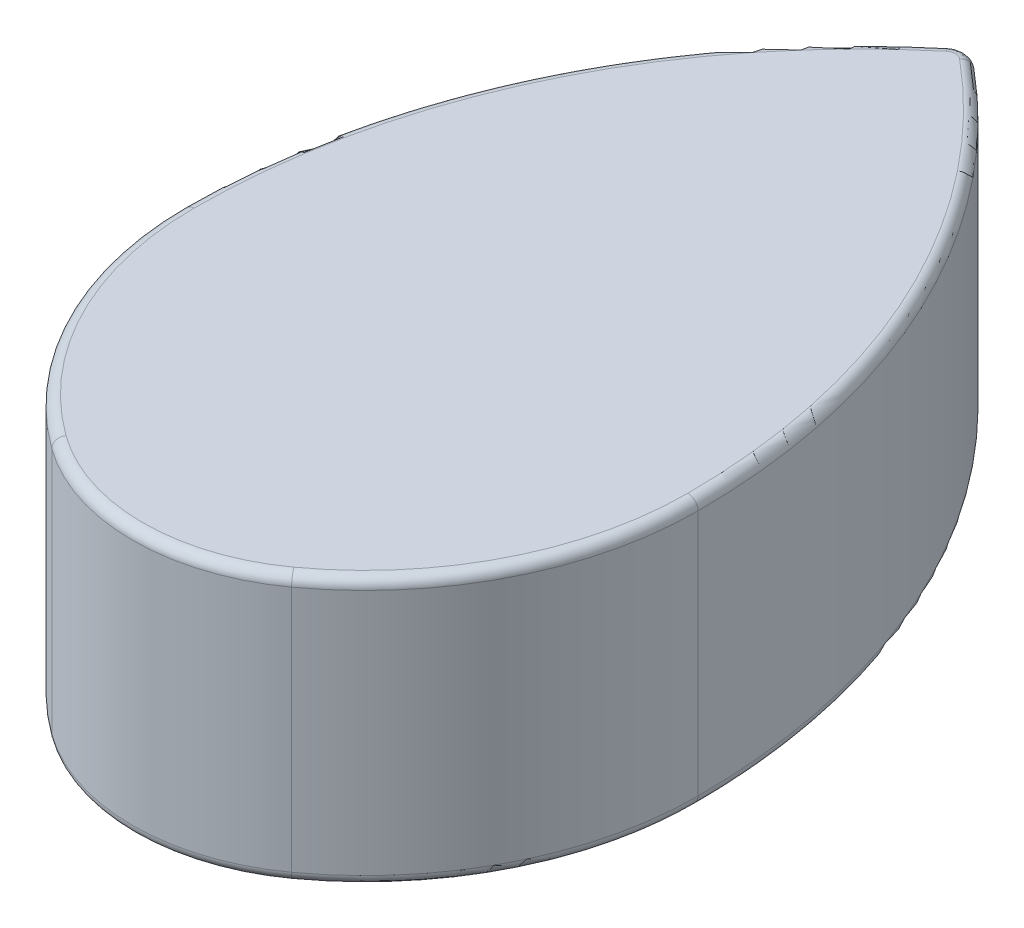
ISO-10303-21;
HEADER;
FILE_DESCRIPTION(('STEP AP214'),'2;1');
FILE_NAME('part.step','',(''),(''),'','','');
FILE_SCHEMA(('AUTOMOTIVE_DESIGN { 1 0 10303 214 1 1 1 1 }'));
ENDSEC;
DATA;
#1=APPLICATION_CONTEXT('core data for automotive mechanical design processes');
#2=APPLICATION_PROTOCOL_DEFINITION('international standard','automotive_design',2000,#1);
#3=PRODUCT_CONTEXT('',#1,'mechanical');
#4=PRODUCT('Part','Part','',(#3));
#5=PRODUCT_RELATED_PRODUCT_CATEGORY('part','',(#4));
#6=PRODUCT_DEFINITION_FORMATION('','',#4);
#7=PRODUCT_DEFINITION_CONTEXT('part definition',#1,'design');
#8=PRODUCT_DEFINITION('design','',#6,#7);
#9=PRODUCT_DEFINITION_SHAPE('','',#8);
#10=(LENGTH_UNIT() NAMED_UNIT(*) SI_UNIT(.MILLI.,.METRE.));
#11=(NAMED_UNIT(*) PLANE_ANGLE_UNIT() SI_UNIT($,.RADIAN.));
#12=(NAMED_UNIT(*) SI_UNIT($,.STERADIAN.) SOLID_ANGLE_UNIT());
#13=UNCERTAINTY_MEASURE_WITH_UNIT(LENGTH_MEASURE(1.E-05),#10,'distance_accuracy_value','');
#14=(GEOMETRIC_REPRESENTATION_CONTEXT(3) GLOBAL_UNCERTAINTY_ASSIGNED_CONTEXT((#13)) GLOBAL_UNIT_ASSIGNED_CONTEXT((#10,
#11,#12)) REPRESENTATION_CONTEXT('',''));
#15=CARTESIAN_POINT('',(0.,0.,0.));
#16=DIRECTION('',(0.,0.,1.));
#17=DIRECTION('',(1.,0.,0.));
#18=AXIS2_PLACEMENT_3D('',#15,#16,#17);
#19=CARTESIAN_POINT('',(7.41103409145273,0.,0.));
#20=DIRECTION('',(0.,1.,0.));
#21=DIRECTION('',(-1.,0.,0.));
#22=AXIS2_PLACEMENT_3D('',#19,#20,#21);
#23=CYLINDRICAL_SURFACE('',#22,32.6110340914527);
#24=CARTESIAN_POINT('',(7.41103409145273,1.,0.));
#25=DIRECTION('',(0.,-1.,0.));
#26=DIRECTION('',(-0.890972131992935,0.,0.454057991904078));
#27=AXIS2_PLACEMENT_3D('',#24,#25,#26);
#28=CIRCLE('',#27,32.6110340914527);
#29=CARTESIAN_POINT('',(-11.7532535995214,1.,26.3857844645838));
#30=VERTEX_POINT('',#29);
#31=CARTESIAN_POINT('',(-25.2,1.,0.));
#32=VERTEX_POINT('',#31);
#33=EDGE_CURVE('E417',#30,#32,#28,.T.);
#34=ORIENTED_EDGE('',*,*,#33,.F.);
#35=DIRECTION('',(0.,-1.,0.));
#36=VECTOR('',#35,1.);
#37=CARTESIAN_POINT('',(-11.7532535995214,0.,26.3857844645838));
#38=LINE('',#37,#36);
#39=CARTESIAN_POINT('',(-11.7532535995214,25.2,26.3857844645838));
#40=VERTEX_POINT('',#39);
#41=EDGE_CURVE('E528',#40,#30,#38,.T.);
#42=ORIENTED_EDGE('',*,*,#41,.F.);
#43=CARTESIAN_POINT('',(7.41103409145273,25.2,0.));
#44=DIRECTION('',(0.,1.,0.));
#45=DIRECTION('',(-0.890972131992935,0.,0.454057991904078));
#46=AXIS2_PLACEMENT_3D('',#43,#44,#45);
#47=CIRCLE('',#46,32.6110340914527);
#48=CARTESIAN_POINT('',(-25.2,25.2,0.));
#49=VERTEX_POINT('',#48);
#50=EDGE_CURVE('E401',#49,#40,#47,.T.);
#51=ORIENTED_EDGE('',*,*,#50,.F.);
#52=DIRECTION('',(0.,1.,0.));
#53=VECTOR('',#52,1.);
#54=CARTESIAN_POINT('',(-25.2,0.,0.));
#55=LINE('',#54,#53);
#56=EDGE_CURVE('E26',#32,#49,#55,.T.);
#57=ORIENTED_EDGE('',*,*,#56,.F.);
#58=EDGE_LOOP('',(#34,#42,#51,#57));
#59=FACE_BOUND('',#58,.T.);
#60=ADVANCED_FACE('F15',(#59),#23,.T.);
#61=CARTESIAN_POINT('',(0.,26.2,-13.3986959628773));
#62=DIRECTION('',(0.,1.,0.));
#63=DIRECTION('',(1.,0.,0.));
#64=AXIS2_PLACEMENT_3D('',#61,#62,#63);
#65=PLANE('',#64);
#66=CARTESIAN_POINT('',(-41.0454120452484,26.2,0.));
#67=DIRECTION('',(0.,-1.,0.));
#68=DIRECTION('',(0.905230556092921,0.,-0.424920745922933));
#69=AXIS2_PLACEMENT_3D('',#66,#67,#68);
#70=CIRCLE('',#69,65.2454120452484);
#71=CARTESIAN_POINT('',(0.638884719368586,26.2,-50.193457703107));
#72=VERTEX_POINT('',#71);
#73=CARTESIAN_POINT('',(24.2,26.2,0.));
#74=VERTEX_POINT('',#73);
#75=EDGE_CURVE('E421',#72,#74,#70,.T.);
#76=ORIENTED_EDGE('',*,*,#75,.F.);
#77=CARTESIAN_POINT('',(0.,26.2,-49.4241552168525));
#78=DIRECTION('',(0.,-1.,0.));
#79=DIRECTION('',(0.,0.,-1.));
#80=AXIS2_PLACEMENT_3D('',#77,#78,#79);
#81=CIRCLE('',#80,1.);
#82=CARTESIAN_POINT('',(-0.638884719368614,26.2,-50.193457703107));
#83=VERTEX_POINT('',#82);
#84=EDGE_CURVE('E388',#83,#72,#81,.T.);
#85=ORIENTED_EDGE('',*,*,#84,.F.);
#86=CARTESIAN_POINT('',(41.0454120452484,26.2,0.));
#87=DIRECTION('',(0.,-1.,0.));
#88=DIRECTION('',(-0.905230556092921,0.,-0.424920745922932));
#89=AXIS2_PLACEMENT_3D('',#86,#87,#88);
#90=CIRCLE('',#89,65.2454120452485);
#91=CARTESIAN_POINT('',(-24.2,26.2,0.));
#92=VERTEX_POINT('',#91);
#93=EDGE_CURVE('E435',#92,#83,#90,.T.);
#94=ORIENTED_EDGE('',*,*,#93,.F.);
#95=CARTESIAN_POINT('',(7.41103409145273,26.2,0.));
#96=DIRECTION('',(0.,-1.,0.));
#97=DIRECTION('',(-0.890972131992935,0.,0.454057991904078));
#98=AXIS2_PLACEMENT_3D('',#95,#96,#97);
#99=CIRCLE('',#98,31.6110340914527);
#100=CARTESIAN_POINT('',(-11.1655909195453,26.2,25.5766784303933));
#101=VERTEX_POINT('',#100);
#102=EDGE_CURVE('E408',#101,#92,#99,.T.);
#103=ORIENTED_EDGE('',*,*,#102,.F.);
#104=CARTESIAN_POINT('',(0.,26.2,10.2036637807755));
#105=DIRECTION('',(0.,-1.,0.));
#106=DIRECTION('',(0.,0.,1.));
#107=AXIS2_PLACEMENT_3D('',#104,#105,#106);
#108=CIRCLE('',#107,19.);
#109=CARTESIAN_POINT('',(11.1655909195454,26.2,25.5766784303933));
#110=VERTEX_POINT('',#109);
#111=EDGE_CURVE('E400',#110,#101,#108,.T.);
#112=ORIENTED_EDGE('',*,*,#111,.F.);
#113=CARTESIAN_POINT('',(-7.41103409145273,26.2,0.));
#114=DIRECTION('',(0.,-1.,0.));
#115=DIRECTION('',(0.890972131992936,0.,0.454057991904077));
#116=AXIS2_PLACEMENT_3D('',#113,#114,#115);
#117=CIRCLE('',#116,31.6110340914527);
#118=EDGE_CURVE('E40',#74,#110,#117,.T.);
#119=ORIENTED_EDGE('',*,*,#118,.F.);
#120=EDGE_LOOP('',(#76,#85,#94,#103,#112,#119));
#121=FACE_BOUND('',#120,.T.);
#122=ADVANCED_FACE('F508',(#121),#65,.T.);
#123=CARTESIAN_POINT('',(0.,0.,-49.4241552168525));
#124=DIRECTION('',(0.,1.,0.));
#125=DIRECTION('',(0.,0.,-1.));
#126=AXIS2_PLACEMENT_3D('',#123,#124,#125);
#127=CYLINDRICAL_SURFACE('',#126,2.);
#128=CARTESIAN_POINT('',(0.,1.,-49.4241552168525));
#129=DIRECTION('',(0.,-1.,0.));
#130=DIRECTION('',(0.,0.,-1.));
#131=AXIS2_PLACEMENT_3D('',#128,#129,#130);
#132=CIRCLE('',#131,2.);
#133=CARTESIAN_POINT('',(-1.27776943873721,1.,-50.9627601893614));
#134=VERTEX_POINT('',#133);
#135=CARTESIAN_POINT('',(1.27776943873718,1.,-50.9627601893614));
#136=VERTEX_POINT('',#135);
#137=EDGE_CURVE('E452',#134,#136,#132,.T.);
#138=ORIENTED_EDGE('',*,*,#137,.F.);
#139=DIRECTION('',(0.,1.,0.));
#140=VECTOR('',#139,1.);
#141=CARTESIAN_POINT('',(-1.27776943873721,0.,-50.9627601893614));
#142=LINE('',#141,#140);
#143=CARTESIAN_POINT('',(-1.27776943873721,25.2,-50.9627601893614));
#144=VERTEX_POINT('',#143);
#145=EDGE_CURVE('E10',#134,#144,#142,.T.);
#146=ORIENTED_EDGE('',*,*,#145,.T.);
#147=CARTESIAN_POINT('',(0.,25.2,-49.4241552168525));
#148=DIRECTION('',(0.,1.,0.));
#149=DIRECTION('',(0.,0.,-1.));
#150=AXIS2_PLACEMENT_3D('',#147,#148,#149);
#151=CIRCLE('',#150,2.);
#152=CARTESIAN_POINT('',(1.27776943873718,25.2,-50.9627601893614));
#153=VERTEX_POINT('',#152);
#154=EDGE_CURVE('E392',#153,#144,#151,.T.);
#155=ORIENTED_EDGE('',*,*,#154,.F.);
#156=DIRECTION('',(0.,-1.,0.));
#157=VECTOR('',#156,1.);
#158=CARTESIAN_POINT('',(1.27776943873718,0.,-50.9627601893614));
#159=LINE('',#158,#157);
#160=EDGE_CURVE('E447',#153,#136,#159,.T.);
#161=ORIENTED_EDGE('',*,*,#160,.T.);
#162=EDGE_LOOP('',(#138,#146,#155,#161));
#163=FACE_BOUND('',#162,.T.);
#164=ADVANCED_FACE('F485',(#163),#127,.T.);
#165=CARTESIAN_POINT('',(41.0454120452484,0.,0.));
#166=DIRECTION('',(0.,1.,0.));
#167=DIRECTION('',(-0.619596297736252,0.,-0.784920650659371));
#168=AXIS2_PLACEMENT_3D('',#165,#166,#167);
#169=CYLINDRICAL_SURFACE('',#168,66.2454120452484);
#170=CARTESIAN_POINT('',(41.0454120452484,1.,0.));
#171=DIRECTION('',(0.,-1.,0.));
#172=DIRECTION('',(-0.905230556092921,0.,-0.424920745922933));
#173=AXIS2_PLACEMENT_3D('',#170,#171,#172);
#174=CIRCLE('',#173,66.2454120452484);
#175=EDGE_CURVE('E541',#32,#134,#174,.T.);
#176=ORIENTED_EDGE('',*,*,#175,.F.);
#177=ORIENTED_EDGE('',*,*,#56,.T.);
#178=CARTESIAN_POINT('',(41.0454120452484,25.2,0.));
#179=DIRECTION('',(0.,1.,0.));
#180=DIRECTION('',(-0.905230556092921,0.,-0.424920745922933));
#181=AXIS2_PLACEMENT_3D('',#178,#179,#180);
#182=CIRCLE('',#181,66.2454120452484);
#183=EDGE_CURVE('E454',#144,#49,#182,.T.);
#184=ORIENTED_EDGE('',*,*,#183,.F.);
#185=ORIENTED_EDGE('',*,*,#145,.F.);
#186=EDGE_LOOP('',(#176,#177,#184,#185));
#187=FACE_BOUND('',#186,.T.);
#188=ADVANCED_FACE('F478',(#187),#169,.T.);
#189=CARTESIAN_POINT('',(-7.41103409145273,25.2,0.));
#190=DIRECTION('',(0.,1.,0.));
#191=DIRECTION('',(0.,0.,1.));
#192=AXIS2_PLACEMENT_3D('',#189,#190,#191);
#193=TOROIDAL_SURFACE('',#192,31.6110340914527,1.);
#194=CARTESIAN_POINT('',(24.2,25.2,0.));
#195=DIRECTION('',(0.,0.,-1.));
#196=DIRECTION('',(0.,1.,0.));
#197=AXIS2_PLACEMENT_3D('',#194,#195,#196);
#198=CIRCLE('',#197,1.);
#199=CARTESIAN_POINT('',(25.2,25.2,0.));
#200=VERTEX_POINT('',#199);
#201=EDGE_CURVE('E440',#74,#200,#198,.T.);
#202=ORIENTED_EDGE('',*,*,#201,.F.);
#203=ORIENTED_EDGE('',*,*,#118,.T.);
#204=CARTESIAN_POINT('',(11.1655909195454,25.2,25.5766784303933));
#205=DIRECTION('',(-0.809106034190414,0.,0.587662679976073));
#206=DIRECTION('',(0.587662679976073,0.,0.809106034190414));
#207=AXIS2_PLACEMENT_3D('',#204,#205,#206);
#208=CIRCLE('',#207,1.);
#209=CARTESIAN_POINT('',(11.7532535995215,25.2,26.3857844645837));
#210=VERTEX_POINT('',#209);
#211=EDGE_CURVE('E396',#210,#110,#208,.T.);
#212=ORIENTED_EDGE('',*,*,#211,.F.);
#213=CARTESIAN_POINT('',(-7.41103409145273,25.2,0.));
#214=DIRECTION('',(0.,1.,0.));
#215=DIRECTION('',(0.890972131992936,0.,0.454057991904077));
#216=AXIS2_PLACEMENT_3D('',#213,#214,#215);
#217=CIRCLE('',#216,32.6110340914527);
#218=EDGE_CURVE('E443',#210,#200,#217,.T.);
#219=ORIENTED_EDGE('',*,*,#218,.T.);
#220=EDGE_LOOP('',(#202,#203,#212,#219));
#221=FACE_BOUND('',#220,.T.);
#222=ADVANCED_FACE('F475',(#221),#193,.T.);
#223=CARTESIAN_POINT('',(0.,25.2,10.2036637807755));
#224=DIRECTION('',(0.,-1.,0.));
#225=DIRECTION('',(0.,0.,1.));
#226=AXIS2_PLACEMENT_3D('',#223,#224,#225);
#227=TOROIDAL_SURFACE('',#226,19.,1.);
#228=ORIENTED_EDGE('',*,*,#211,.T.);
#229=ORIENTED_EDGE('',*,*,#111,.T.);
#230=CARTESIAN_POINT('',(-11.1655909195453,25.2,25.5766784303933));
#231=DIRECTION('',(-0.809106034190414,0.,-0.587662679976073));
#232=DIRECTION('',(-0.587662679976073,0.,0.809106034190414));
#233=AXIS2_PLACEMENT_3D('',#230,#231,#232);
#234=CIRCLE('',#233,1.);
#235=EDGE_CURVE('E412',#40,#101,#234,.T.);
#236=ORIENTED_EDGE('',*,*,#235,.F.);
#237=CARTESIAN_POINT('',(0.,25.2,10.2036637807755));
#238=DIRECTION('',(0.,1.,0.));
#239=DIRECTION('',(0.,0.,1.));
#240=AXIS2_PLACEMENT_3D('',#237,#238,#239);
#241=CIRCLE('',#240,20.);
#242=EDGE_CURVE('E406',#40,#210,#241,.T.);
#243=ORIENTED_EDGE('',*,*,#242,.T.);
#244=EDGE_LOOP('',(#228,#229,#236,#243));
#245=FACE_BOUND('',#244,.T.);
#246=ADVANCED_FACE('F273',(#245),#227,.T.);
#247=CARTESIAN_POINT('',(7.41103409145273,25.2,0.));
#248=DIRECTION('',(0.,1.,0.));
#249=DIRECTION('',(0.,0.,1.));
#250=AXIS2_PLACEMENT_3D('',#247,#248,#249);
#251=TOROIDAL_SURFACE('',#250,31.6110340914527,1.);
#252=ORIENTED_EDGE('',*,*,#235,.T.);
#253=ORIENTED_EDGE('',*,*,#102,.T.);
#254=CARTESIAN_POINT('',(-24.2,25.2,0.));
#255=DIRECTION('',(0.,0.,-1.));
#256=DIRECTION('',(-1.,0.,0.));
#257=AXIS2_PLACEMENT_3D('',#254,#255,#256);
#258=CIRCLE('',#257,0.999999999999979);
#259=EDGE_CURVE('E431',#49,#92,#258,.T.);
#260=ORIENTED_EDGE('',*,*,#259,.F.);
#261=ORIENTED_EDGE('',*,*,#50,.T.);
#262=EDGE_LOOP('',(#252,#253,#260,#261));
#263=FACE_BOUND('',#262,.T.);
#264=ADVANCED_FACE('F501',(#263),#251,.T.);
#265=CARTESIAN_POINT('',(41.0454120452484,25.2,0.));
#266=DIRECTION('',(0.,1.,0.));
#267=DIRECTION('',(0.,0.,1.));
#268=AXIS2_PLACEMENT_3D('',#265,#266,#267);
#269=TOROIDAL_SURFACE('',#268,65.2454120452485,1.);
#270=ORIENTED_EDGE('',*,*,#259,.T.);
#271=ORIENTED_EDGE('',*,*,#93,.T.);
#272=CARTESIAN_POINT('',(-0.638884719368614,25.2,-50.193457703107));
#273=DIRECTION('',(0.76930248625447,0.,-0.638884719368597));
#274=DIRECTION('',(-0.638884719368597,0.,-0.76930248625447));
#275=AXIS2_PLACEMENT_3D('',#272,#273,#274);
#276=CIRCLE('',#275,1.);
#277=EDGE_CURVE('E393',#144,#83,#276,.T.);
#278=ORIENTED_EDGE('',*,*,#277,.F.);
#279=ORIENTED_EDGE('',*,*,#183,.T.);
#280=EDGE_LOOP('',(#270,#271,#278,#279));
#281=FACE_BOUND('',#280,.T.);
#282=ADVANCED_FACE('F498',(#281),#269,.T.);
#283=CARTESIAN_POINT('',(-0.638884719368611,26.2,-50.193457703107));
#284=CARTESIAN_POINT('',(0.,26.2,-50.7240340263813));
#285=CARTESIAN_POINT('',(0.638884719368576,26.2,-50.1934577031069));
#286=CARTESIAN_POINT('',(-1.2777694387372,26.2,-50.9627601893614));
#287=CARTESIAN_POINT('',(0.,26.2,-52.0239128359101));
#288=CARTESIAN_POINT('',(1.27776943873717,26.2,-50.9627601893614));
#289=CARTESIAN_POINT('',(-1.2777694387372,25.2,-50.9627601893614));
#290=CARTESIAN_POINT('',(0.,25.2,-52.0239128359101));
#291=CARTESIAN_POINT('',(1.27776943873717,25.2,-50.9627601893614));
#292=(BOUNDED_SURFACE() B_SPLINE_SURFACE(2,2,((#283,#284,#285),(#286,#287,#288),(#289,#290,
#291)),.UNSPECIFIED.,.F.,.F.,.F.) B_SPLINE_SURFACE_WITH_KNOTS((3,3),(3,3),(-1.5707963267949,0.),
(-0.693047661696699,0.6930476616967),
.UNSPECIFIED.) GEOMETRIC_REPRESENTATION_ITEM() RATIONAL_B_SPLINE_SURFACE(((1.,0.769302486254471,
1.),(0.707106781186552,0.543979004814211,0.707106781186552),(1.,0.769302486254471,1.))) REPRESENTATION_ITEM('') SURFACE());
#293=CARTESIAN_POINT('',(0.638884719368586,25.2,-50.193457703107));
#294=DIRECTION('',(0.769302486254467,0.,0.638884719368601));
#295=DIRECTION('',(0.638884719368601,0.,-0.769302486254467));
#296=AXIS2_PLACEMENT_3D('',#293,#294,#295);
#297=CIRCLE('',#296,0.999999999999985);
#298=EDGE_CURVE('E436',#153,#72,#297,.T.);
#299=ORIENTED_EDGE('',*,*,#277,.T.);
#300=ORIENTED_EDGE('',*,*,#84,.T.);
#301=ORIENTED_EDGE('',*,*,#298,.F.);
#302=ORIENTED_EDGE('',*,*,#154,.T.);
#303=EDGE_LOOP('',(#299,#300,#301,#302));
#304=FACE_BOUND('',#303,.T.);
#305=ADVANCED_FACE('F340',(#304),#292,.F.);
#306=CARTESIAN_POINT('',(-41.0454120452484,25.2,0.));
#307=DIRECTION('',(0.,1.,0.));
#308=DIRECTION('',(0.,0.,1.));
#309=AXIS2_PLACEMENT_3D('',#306,#307,#308);
#310=TOROIDAL_SURFACE('',#309,65.2454120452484,1.);
#311=ORIENTED_EDGE('',*,*,#201,.T.);
#312=CARTESIAN_POINT('',(-41.0454120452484,25.2,0.));
#313=DIRECTION('',(0.,1.,0.));
#314=DIRECTION('',(0.905230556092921,0.,-0.424920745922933));
#315=AXIS2_PLACEMENT_3D('',#312,#313,#314);
#316=CIRCLE('',#315,66.2454120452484);
#317=EDGE_CURVE('E561',#200,#153,#316,.T.);
#318=ORIENTED_EDGE('',*,*,#317,.T.);
#319=ORIENTED_EDGE('',*,*,#298,.T.);
#320=ORIENTED_EDGE('',*,*,#75,.T.);
#321=EDGE_LOOP('',(#311,#318,#319,#320));
#322=FACE_BOUND('',#321,.T.);
#323=ADVANCED_FACE('F496',(#322),#310,.T.);
#324=CARTESIAN_POINT('',(0.,0.,-13.3986959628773));
#325=DIRECTION('',(0.,1.,0.));
#326=DIRECTION('',(1.,0.,0.));
#327=AXIS2_PLACEMENT_3D('',#324,#325,#326);
#328=PLANE('',#327);
#329=CARTESIAN_POINT('',(0.,0.,0.));
#330=DIRECTION('',(0.,1.,0.));
#331=DIRECTION('',(1.,0.,0.));
#332=AXIS2_PLACEMENT_3D('',#329,#330,#331);
#333=CIRCLE('',#332,24.25);
#334=CARTESIAN_POINT('',(-24.0365612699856,0.,3.21033056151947));
#335=VERTEX_POINT('',#334);
#336=CARTESIAN_POINT('',(24.0365612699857,0.,3.2103305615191));
#337=VERTEX_POINT('',#336);
#338=EDGE_CURVE('E200',#335,#337,#333,.T.);
#339=ORIENTED_EDGE('',*,*,#338,.T.);
#340=CARTESIAN_POINT('',(-7.41103409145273,0.,0.));
#341=DIRECTION('',(0.,1.,0.));
#342=DIRECTION('',(0.890972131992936,0.,0.454057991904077));
#343=AXIS2_PLACEMENT_3D('',#340,#341,#342);
#344=CIRCLE('',#343,31.6110340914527);
#345=CARTESIAN_POINT('',(11.1655909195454,0.,25.5766784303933));
#346=VERTEX_POINT('',#345);
#347=EDGE_CURVE('E564',#346,#337,#344,.T.);
#348=ORIENTED_EDGE('',*,*,#347,.F.);
#349=CARTESIAN_POINT('',(0.,0.,10.2036637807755));
#350=DIRECTION('',(0.,1.,0.));
#351=DIRECTION('',(0.,0.,1.));
#352=AXIS2_PLACEMENT_3D('',#349,#350,#351);
#353=CIRCLE('',#352,19.);
#354=CARTESIAN_POINT('',(-11.1655909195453,0.,25.5766784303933));
#355=VERTEX_POINT('',#354);
#356=EDGE_CURVE('E407',#355,#346,#353,.T.);
#357=ORIENTED_EDGE('',*,*,#356,.F.);
#358=CARTESIAN_POINT('',(7.41103409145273,0.,0.));
#359=DIRECTION('',(0.,1.,0.));
#360=DIRECTION('',(-0.890972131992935,0.,0.454057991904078));
#361=AXIS2_PLACEMENT_3D('',#358,#359,#360);
#362=CIRCLE('',#361,31.6110340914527);
#363=EDGE_CURVE('E535',#335,#355,#362,.T.);
#364=ORIENTED_EDGE('',*,*,#363,.F.);
#365=EDGE_LOOP('',(#339,#348,#357,#364));
#366=FACE_BOUND('',#365,.T.);
#367=ADVANCED_FACE('F493',(#366),#328,.F.);
#368=CARTESIAN_POINT('',(-41.0454120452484,0.,0.));
#369=DIRECTION('',(0.,1.,0.));
#370=DIRECTION('',(1.,0.,0.));
#371=AXIS2_PLACEMENT_3D('',#368,#369,#370);
#372=CYLINDRICAL_SURFACE('',#371,66.2454120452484);
#373=CARTESIAN_POINT('',(-41.0454120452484,1.,0.));
#374=DIRECTION('',(0.,-1.,0.));
#375=DIRECTION('',(0.905230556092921,0.,-0.424920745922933));
#376=AXIS2_PLACEMENT_3D('',#373,#374,#375);
#377=CIRCLE('',#376,66.2454120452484);
#378=CARTESIAN_POINT('',(25.2,1.,0.));
#379=VERTEX_POINT('',#378);
#380=EDGE_CURVE('E453',#136,#379,#377,.T.);
#381=ORIENTED_EDGE('',*,*,#380,.F.);
#382=ORIENTED_EDGE('',*,*,#160,.F.);
#383=ORIENTED_EDGE('',*,*,#317,.F.);
#384=DIRECTION('',(0.,1.,0.));
#385=VECTOR('',#384,1.);
#386=CARTESIAN_POINT('',(25.2,0.,0.));
#387=LINE('',#386,#385);
#388=EDGE_CURVE('E448',#379,#200,#387,.T.);
#389=ORIENTED_EDGE('',*,*,#388,.F.);
#390=EDGE_LOOP('',(#381,#382,#383,#389));
#391=FACE_BOUND('',#390,.T.);
#392=ADVANCED_FACE('F226',(#391),#372,.T.);
#393=CARTESIAN_POINT('',(-7.41103409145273,0.,0.));
#394=DIRECTION('',(0.,1.,0.));
#395=DIRECTION('',(0.227255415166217,0.,0.97383518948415));
#396=AXIS2_PLACEMENT_3D('',#393,#394,#395);
#397=CYLINDRICAL_SURFACE('',#396,32.6110340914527);
#398=CARTESIAN_POINT('',(-7.41103409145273,1.,0.));
#399=DIRECTION('',(0.,-1.,0.));
#400=DIRECTION('',(0.890972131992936,0.,0.454057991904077));
#401=AXIS2_PLACEMENT_3D('',#398,#399,#400);
#402=CIRCLE('',#401,32.6110340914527);
#403=CARTESIAN_POINT('',(11.7532535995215,1.,26.3857844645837));
#404=VERTEX_POINT('',#403);
#405=EDGE_CURVE('E545',#379,#404,#402,.T.);
#406=ORIENTED_EDGE('',*,*,#405,.F.);
#407=ORIENTED_EDGE('',*,*,#388,.T.);
#408=ORIENTED_EDGE('',*,*,#218,.F.);
#409=DIRECTION('',(0.,1.,0.));
#410=VECTOR('',#409,1.);
#411=CARTESIAN_POINT('',(11.7532535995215,0.,26.3857844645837));
#412=LINE('',#411,#410);
#413=EDGE_CURVE('E402',#404,#210,#412,.T.);
#414=ORIENTED_EDGE('',*,*,#413,.F.);
#415=EDGE_LOOP('',(#406,#407,#408,#414));
#416=FACE_BOUND('',#415,.T.);
#417=ADVANCED_FACE('F479',(#416),#397,.T.);
#418=CARTESIAN_POINT('',(0.,0.,10.2036637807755));
#419=DIRECTION('',(0.,1.,0.));
#420=DIRECTION('',(0.,0.,1.));
#421=AXIS2_PLACEMENT_3D('',#418,#419,#420);
#422=CYLINDRICAL_SURFACE('',#421,20.);
#423=CARTESIAN_POINT('',(0.,1.,10.2036637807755));
#424=DIRECTION('',(0.,-1.,0.));
#425=DIRECTION('',(0.,0.,1.));
#426=AXIS2_PLACEMENT_3D('',#423,#424,#425);
#427=CIRCLE('',#426,20.);
#428=EDGE_CURVE('E413',#404,#30,#427,.T.);
#429=ORIENTED_EDGE('',*,*,#428,.F.);
#430=ORIENTED_EDGE('',*,*,#413,.T.);
#431=ORIENTED_EDGE('',*,*,#242,.F.);
#432=ORIENTED_EDGE('',*,*,#41,.T.);
#433=EDGE_LOOP('',(#429,#430,#431,#432));
#434=FACE_BOUND('',#433,.T.);
#435=ADVANCED_FACE('F233',(#434),#422,.T.);
#436=CARTESIAN_POINT('',(0.,1.,10.2036637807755));
#437=DIRECTION('',(0.,1.,0.));
#438=DIRECTION('',(0.,0.,1.));
#439=AXIS2_PLACEMENT_3D('',#436,#437,#438);
#440=TOROIDAL_SURFACE('',#439,19.,1.);
#441=CARTESIAN_POINT('',(11.1655909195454,1.,25.5766784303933));
#442=DIRECTION('',(-0.809106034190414,0.,0.587662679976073));
#443=DIRECTION('',(0.,-1.,0.));
#444=AXIS2_PLACEMENT_3D('',#441,#442,#443);
#445=CIRCLE('',#444,1.);
#446=EDGE_CURVE('E549',#346,#404,#445,.T.);
#447=ORIENTED_EDGE('',*,*,#446,.T.);
#448=ORIENTED_EDGE('',*,*,#428,.T.);
#449=CARTESIAN_POINT('',(-11.1655909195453,1.,25.5766784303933));
#450=DIRECTION('',(-0.809106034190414,0.,-0.587662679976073));
#451=DIRECTION('',(0.,-1.,0.));
#452=AXIS2_PLACEMENT_3D('',#449,#450,#451);
#453=CIRCLE('',#452,1.);
#454=EDGE_CURVE('E532',#355,#30,#453,.T.);
#455=ORIENTED_EDGE('',*,*,#454,.F.);
#456=ORIENTED_EDGE('',*,*,#356,.T.);
#457=EDGE_LOOP('',(#447,#448,#455,#456));
#458=FACE_BOUND('',#457,.T.);
#459=ADVANCED_FACE('F225',(#458),#440,.T.);
#460=CARTESIAN_POINT('',(7.41103409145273,1.,0.));
#461=DIRECTION('',(0.,1.,0.));
#462=DIRECTION('',(0.,0.,1.));
#463=AXIS2_PLACEMENT_3D('',#460,#461,#462);
#464=TOROIDAL_SURFACE('',#463,31.6110340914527,1.);
#465=CARTESIAN_POINT('',(-24.25,0.00125078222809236,0.));
#466=CARTESIAN_POINT('',(-24.250000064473,0.00125121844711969,0.133990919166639));
#467=CARTESIAN_POINT('',(-24.2488891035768,0.00123776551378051,0.267981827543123));
#468=CARTESIAN_POINT('',(-24.2444453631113,0.00118624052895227,0.535983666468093));
#469=CARTESIAN_POINT('',(-24.2411116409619,0.00114815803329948,0.669994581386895));
#470=CARTESIAN_POINT('',(-24.2322208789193,0.00105051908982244,0.937994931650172));
#471=CARTESIAN_POINT('',(-24.2266629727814,0.00099095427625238,1.07198433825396));
#472=CARTESIAN_POINT('',(-24.2133231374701,0.000856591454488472,1.33990011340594));
#473=CARTESIAN_POINT('',(-24.2055404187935,0.000781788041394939,1.47382644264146));
#474=CARTESIAN_POINT('',(-24.1877509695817,0.000625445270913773,1.7415744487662));
#475=CARTESIAN_POINT('',(-24.1777435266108,0.000543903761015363,1.87539607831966));
#476=CARTESIAN_POINT('',(-24.1555054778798,0.000385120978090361,2.14289303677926));
#477=CARTESIAN_POINT('',(-24.1432742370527,0.000307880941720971,2.27656831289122));
#478=CARTESIAN_POINT('',(-24.1165902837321,0.000170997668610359,2.54373089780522));
#479=CARTESIAN_POINT('',(-24.1021370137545,0.00011135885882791,2.6772181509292));
#480=CARTESIAN_POINT('',(-24.0710119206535,2.60740297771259E-05,2.94396306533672));
#481=CARTESIAN_POINT('',(-24.0543396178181,4.35373861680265E-07,3.07722067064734));
#482=CARTESIAN_POINT('',(-24.0365612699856,0.,3.21033056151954));
#483=B_SPLINE_CURVE_WITH_KNOTS('',3,(#465,#466,#467,#468,#469,#470,#471,#472,#473,#474,#475,
#476,#477,#478,#479,#480,#481,#482),.UNSPECIFIED.,.F.,.F.,(4,2,2,2,2,2,2,2,4),(0.,
0.401968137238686,0.804106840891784,1.2064023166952,1.60884072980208,2.01140820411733,
2.41409082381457,2.81687463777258,3.21974566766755),.UNSPECIFIED.);
#484=CARTESIAN_POINT('',(-24.25,0.00125078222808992,0.));
#485=VERTEX_POINT('',#484);
#486=EDGE_CURVE('E192',#485,#335,#483,.T.);
#487=ORIENTED_EDGE('',*,*,#486,.T.);
#488=ORIENTED_EDGE('',*,*,#363,.T.);
#489=ORIENTED_EDGE('',*,*,#454,.T.);
#490=ORIENTED_EDGE('',*,*,#33,.T.);
#491=CARTESIAN_POINT('',(-24.2,1.,0.));
#492=DIRECTION('',(0.,0.,-1.));
#493=DIRECTION('',(0.,-1.,0.));
#494=AXIS2_PLACEMENT_3D('',#491,#492,#493);
#495=CIRCLE('',#494,1.);
#496=EDGE_CURVE('E558',#485,#32,#495,.T.);
#497=ORIENTED_EDGE('',*,*,#496,.F.);
#498=EDGE_LOOP('',(#487,#488,#489,#490,#497));
#499=FACE_BOUND('',#498,.T.);
#500=ADVANCED_FACE('F214',(#499),#464,.T.);
#501=CARTESIAN_POINT('',(41.0454120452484,1.,0.));
#502=DIRECTION('',(0.,1.,0.));
#503=DIRECTION('',(0.,0.,1.));
#504=AXIS2_PLACEMENT_3D('',#501,#502,#503);
#505=TOROIDAL_SURFACE('',#504,65.2454120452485,1.);
#506=CARTESIAN_POINT('',(-24.1704900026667,0.,-1.96211952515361));
#507=CARTESIAN_POINT('',(-24.1771155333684,4.34870764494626E-07,-1.88050352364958));
#508=CARTESIAN_POINT('',(-24.1833278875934,2.60745278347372E-05,-1.79885398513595));
#509=CARTESIAN_POINT('',(-24.1949243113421,0.000111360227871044,-1.63551029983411));
#510=CARTESIAN_POINT('',(-24.2003085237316,0.000171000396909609,-1.55381616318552));
#511=CARTESIAN_POINT('',(-24.2102482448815,0.000307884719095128,-1.39039031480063));
#512=CARTESIAN_POINT('',(-24.2148038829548,0.000385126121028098,-1.30865861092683));
#513=CARTESIAN_POINT('',(-24.2230864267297,0.000543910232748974,-1.14516467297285));
#514=CARTESIAN_POINT('',(-24.2268134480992,0.000625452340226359,-1.06340244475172));
#515=CARTESIAN_POINT('',(-24.2334388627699,0.000781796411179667,-0.899854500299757));
#516=CARTESIAN_POINT('',(-24.2363373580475,0.00085659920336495,-0.818068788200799));
#517=CARTESIAN_POINT('',(-24.2413059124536,0.000990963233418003,-0.654480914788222));
#518=CARTESIAN_POINT('',(-24.2433760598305,0.00105052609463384,-0.572678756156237));
#519=CARTESIAN_POINT('',(-24.2466881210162,0.0011481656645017,-0.409065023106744));
#520=CARTESIAN_POINT('',(-24.2479301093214,0.00118624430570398,-0.327253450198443));
#521=CARTESIAN_POINT('',(-24.2495860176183,0.00123777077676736,-0.163627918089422));
#522=CARTESIAN_POINT('',(-24.2499999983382,0.00125122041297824,-0.0818139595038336));
#523=CARTESIAN_POINT('',(-24.25,0.00125078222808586,0.));
#524=B_SPLINE_CURVE_WITH_KNOTS('',3,(#506,#507,#508,#509,#510,#511,#512,#513,#514,#515,#516,
#517,#518,#519,#520,#521,#522,#523),.UNSPECIFIED.,.F.,.F.,(4,2,2,2,2,2,2,2,4),(0.,
0.245652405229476,0.491262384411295,0.736833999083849,0.982371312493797,1.22787839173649,
1.47335930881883,1.71881814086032,1.96425896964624),.UNSPECIFIED.);
#525=CARTESIAN_POINT('',(-24.1704900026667,0.,-1.96211952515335));
#526=VERTEX_POINT('',#525);
#527=EDGE_CURVE('E185',#526,#485,#524,.T.);
#528=ORIENTED_EDGE('',*,*,#527,.T.);
#529=ORIENTED_EDGE('',*,*,#496,.T.);
#530=ORIENTED_EDGE('',*,*,#175,.T.);
#531=CARTESIAN_POINT('',(-0.638884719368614,1.,-50.193457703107));
#532=DIRECTION('',(0.76930248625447,0.,-0.638884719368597));
#533=DIRECTION('',(0.,-1.,0.));
#534=AXIS2_PLACEMENT_3D('',#531,#532,#533);
#535=CIRCLE('',#534,1.);
#536=CARTESIAN_POINT('',(-0.638884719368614,0.,-50.193457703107));
#537=VERTEX_POINT('',#536);
#538=EDGE_CURVE('E449',#537,#134,#535,.T.);
#539=ORIENTED_EDGE('',*,*,#538,.F.);
#540=CARTESIAN_POINT('',(41.0454120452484,0.,0.));
#541=DIRECTION('',(0.,1.,0.));
#542=DIRECTION('',(-0.905230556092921,0.,-0.424920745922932));
#543=AXIS2_PLACEMENT_3D('',#540,#541,#542);
#544=CIRCLE('',#543,65.2454120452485);
#545=EDGE_CURVE('E376',#537,#526,#544,.T.);
#546=ORIENTED_EDGE('',*,*,#545,.T.);
#547=EDGE_LOOP('',(#528,#529,#530,#539,#546));
#548=FACE_BOUND('',#547,.T.);
#549=ADVANCED_FACE('F224',(#548),#505,.T.);
#550=CARTESIAN_POINT('',(0.638884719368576,0.,-50.1934577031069));
#551=CARTESIAN_POINT('',(0.,0.,-50.7240340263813));
#552=CARTESIAN_POINT('',(-0.638884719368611,0.,-50.193457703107));
#553=CARTESIAN_POINT('',(1.27776943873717,0.,-50.9627601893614));
#554=CARTESIAN_POINT('',(0.,0.,-52.0239128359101));
#555=CARTESIAN_POINT('',(-1.2777694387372,0.,-50.9627601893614));
#556=CARTESIAN_POINT('',(1.27776943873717,1.,-50.9627601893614));
#557=CARTESIAN_POINT('',(0.,1.,-52.0239128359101));
#558=CARTESIAN_POINT('',(-1.2777694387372,1.,-50.9627601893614));
#559=(BOUNDED_SURFACE() B_SPLINE_SURFACE(2,2,((#550,#551,#552),(#553,#554,#555),(#556,#557,
#558)),.UNSPECIFIED.,.F.,.F.,.F.) B_SPLINE_SURFACE_WITH_KNOTS((3,3),(3,3),(-1.5707963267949,0.),
(-0.693047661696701,0.693047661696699),
.UNSPECIFIED.) GEOMETRIC_REPRESENTATION_ITEM() RATIONAL_B_SPLINE_SURFACE(((1.,0.769302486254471,
1.),(0.70710678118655,0.543979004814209,0.70710678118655),(1.,0.769302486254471,1.))) REPRESENTATION_ITEM('') SURFACE());
#560=CARTESIAN_POINT('',(0.638884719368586,1.,-50.193457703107));
#561=DIRECTION('',(0.769302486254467,0.,0.638884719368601));
#562=DIRECTION('',(0.,-1.,0.));
#563=AXIS2_PLACEMENT_3D('',#560,#561,#562);
#564=CIRCLE('',#563,1.);
#565=CARTESIAN_POINT('',(0.638884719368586,0.,-50.193457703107));
#566=VERTEX_POINT('',#565);
#567=EDGE_CURVE('E554',#566,#136,#564,.T.);
#568=CARTESIAN_POINT('',(0.,0.,-49.4241552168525));
#569=DIRECTION('',(0.,1.,0.));
#570=DIRECTION('',(0.,0.,-1.));
#571=AXIS2_PLACEMENT_3D('',#568,#569,#570);
#572=CIRCLE('',#571,1.);
#573=EDGE_CURVE('E366',#566,#537,#572,.T.);
#574=ORIENTED_EDGE('',*,*,#538,.T.);
#575=ORIENTED_EDGE('',*,*,#137,.T.);
#576=ORIENTED_EDGE('',*,*,#567,.F.);
#577=ORIENTED_EDGE('',*,*,#573,.T.);
#578=EDGE_LOOP('',(#574,#575,#576,#577));
#579=FACE_BOUND('',#578,.T.);
#580=ADVANCED_FACE('F239',(#579),#559,.F.);
#581=CARTESIAN_POINT('',(-41.0454120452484,1.,0.));
#582=DIRECTION('',(0.,1.,0.));
#583=DIRECTION('',(0.,0.,1.));
#584=AXIS2_PLACEMENT_3D('',#581,#582,#583);
#585=TOROIDAL_SURFACE('',#584,65.2454120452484,1.);
#586=CARTESIAN_POINT('',(24.25,0.00125078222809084,1.12148986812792E-13));
#587=CARTESIAN_POINT('',(24.2499999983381,0.00125122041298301,-0.0818139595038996));
#588=CARTESIAN_POINT('',(24.2495860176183,0.00123777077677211,-0.163627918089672));
#589=CARTESIAN_POINT('',(24.2479301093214,0.00118624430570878,-0.327253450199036));
#590=CARTESIAN_POINT('',(24.2466881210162,0.00114816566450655,-0.409065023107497));
#591=CARTESIAN_POINT('',(24.2433760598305,0.00105052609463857,-0.572678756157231));
#592=CARTESIAN_POINT('',(24.2413059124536,0.000990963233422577,-0.654480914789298));
#593=CARTESIAN_POINT('',(24.2363373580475,0.000856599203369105,-0.818068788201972));
#594=CARTESIAN_POINT('',(24.2334388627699,0.000781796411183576,-0.899854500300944));
#595=CARTESIAN_POINT('',(24.2268134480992,0.000625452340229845,-1.06340244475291));
#596=CARTESIAN_POINT('',(24.2230864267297,0.000543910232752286,-1.14516467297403));
#597=CARTESIAN_POINT('',(24.2148038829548,0.000385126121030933,-1.30865861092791));
#598=CARTESIAN_POINT('',(24.2102482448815,0.000307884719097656,-1.39039031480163));
#599=CARTESIAN_POINT('',(24.2003085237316,0.000171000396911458,-1.55381616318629));
#600=CARTESIAN_POINT('',(24.1949243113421,0.000111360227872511,-1.63551029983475));
#601=CARTESIAN_POINT('',(24.1833278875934,2.60745278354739E-05,-1.79885398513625));
#602=CARTESIAN_POINT('',(24.1771155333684,4.34870764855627E-07,-1.88050352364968));
#603=CARTESIAN_POINT('',(24.1704900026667,0.,-1.9621195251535));
#604=B_SPLINE_CURVE_WITH_KNOTS('',3,(#586,#587,#588,#589,#590,#591,#592,#593,#594,#595,#596,
#597,#598,#599,#600,#601,#602,#603),.UNSPECIFIED.,.F.,.F.,(4,2,2,2,2,2,2,2,4),(0.,
0.245440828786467,0.490899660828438,0.736380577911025,0.981887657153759,1.22742497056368,
1.47299658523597,1.71860656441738,1.96425896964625),.UNSPECIFIED.);
#605=CARTESIAN_POINT('',(24.25,0.0012507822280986,0.));
#606=VERTEX_POINT('',#605);
#607=CARTESIAN_POINT('',(24.1704900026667,0.,-1.96211952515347));
#608=VERTEX_POINT('',#607);
#609=EDGE_CURVE('E257',#606,#608,#604,.T.);
#610=ORIENTED_EDGE('',*,*,#609,.T.);
#611=CARTESIAN_POINT('',(-41.0454120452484,0.,0.));
#612=DIRECTION('',(0.,1.,0.));
#613=DIRECTION('',(0.905230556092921,0.,-0.424920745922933));
#614=AXIS2_PLACEMENT_3D('',#611,#612,#613);
#615=CIRCLE('',#614,65.2454120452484);
#616=EDGE_CURVE('E363',#608,#566,#615,.T.);
#617=ORIENTED_EDGE('',*,*,#616,.T.);
#618=ORIENTED_EDGE('',*,*,#567,.T.);
#619=ORIENTED_EDGE('',*,*,#380,.T.);
#620=CARTESIAN_POINT('',(24.2,1.,0.));
#621=DIRECTION('',(0.,0.,-1.));
#622=DIRECTION('',(1.,0.,0.));
#623=AXIS2_PLACEMENT_3D('',#620,#621,#622);
#624=CIRCLE('',#623,1.);
#625=EDGE_CURVE('E550',#379,#606,#624,.T.);
#626=ORIENTED_EDGE('',*,*,#625,.T.);
#627=EDGE_LOOP('',(#610,#617,#618,#619,#626));
#628=FACE_BOUND('',#627,.T.);
#629=ADVANCED_FACE('F235',(#628),#585,.T.);
#630=CARTESIAN_POINT('',(-7.41103409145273,1.,0.));
#631=DIRECTION('',(0.,1.,0.));
#632=DIRECTION('',(0.,0.,1.));
#633=AXIS2_PLACEMENT_3D('',#630,#631,#632);
#634=TOROIDAL_SURFACE('',#633,31.6110340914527,1.);
#635=CARTESIAN_POINT('',(24.0365612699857,0.,3.21033056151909));
#636=CARTESIAN_POINT('',(24.0543396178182,4.35373861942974E-07,3.07722067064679));
#637=CARTESIAN_POINT('',(24.0710119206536,2.60740297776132E-05,2.94396306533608));
#638=CARTESIAN_POINT('',(24.1021370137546,0.000111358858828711,2.67721815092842));
#639=CARTESIAN_POINT('',(24.1165902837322,0.000170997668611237,2.5437308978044));
#640=CARTESIAN_POINT('',(24.1432742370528,0.000307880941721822,2.27656831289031));
#641=CARTESIAN_POINT('',(24.1555054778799,0.000385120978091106,2.14289303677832));
#642=CARTESIAN_POINT('',(24.1777435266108,0.000543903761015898,1.87539607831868));
#643=CARTESIAN_POINT('',(24.1877509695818,0.000625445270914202,1.74157444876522));
#644=CARTESIAN_POINT('',(24.2055404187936,0.000781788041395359,1.47382644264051));
#645=CARTESIAN_POINT('',(24.2133231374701,0.000856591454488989,1.33990011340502));
#646=CARTESIAN_POINT('',(24.2266629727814,0.000990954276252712,1.07198433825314));
#647=CARTESIAN_POINT('',(24.2322208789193,0.00105051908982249,0.93799493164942));
#648=CARTESIAN_POINT('',(24.2411116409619,0.00114815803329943,0.669994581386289));
#649=CARTESIAN_POINT('',(24.2444453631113,0.00118624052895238,0.535983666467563));
#650=CARTESIAN_POINT('',(24.2488891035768,0.00123776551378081,0.267981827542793));
#651=CARTESIAN_POINT('',(24.250000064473,0.00125121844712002,0.133990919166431));
#652=CARTESIAN_POINT('',(24.25,0.00125078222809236,0.));
#653=B_SPLINE_CURVE_WITH_KNOTS('',3,(#635,#636,#637,#638,#639,#640,#641,#642,#643,#644,#645,
#646,#647,#648,#649,#650,#651,#652),.UNSPECIFIED.,.F.,.F.,(4,2,2,2,2,2,2,2,4),(0.,
0.402871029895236,0.805654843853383,1.20833746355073,1.61090493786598,2.01334335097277,
2.41563882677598,2.81777753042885,3.21974566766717),.UNSPECIFIED.);
#654=EDGE_CURVE('E841',#337,#606,#653,.T.);
#655=ORIENTED_EDGE('',*,*,#654,.T.);
#656=ORIENTED_EDGE('',*,*,#625,.F.);
#657=ORIENTED_EDGE('',*,*,#405,.T.);
#658=ORIENTED_EDGE('',*,*,#446,.F.);
#659=ORIENTED_EDGE('',*,*,#347,.T.);
#660=EDGE_LOOP('',(#655,#656,#657,#658,#659));
#661=FACE_BOUND('',#660,.T.);
#662=ADVANCED_FACE('F230',(#661),#634,.T.);
#663=CARTESIAN_POINT('',(0.,25.,0.));
#664=DIRECTION('',(0.,-1.,0.));
#665=DIRECTION('',(0.,0.,-1.));
#666=AXIS2_PLACEMENT_3D('',#663,#664,#665);
#667=PLANE('',#666);
#668=CARTESIAN_POINT('',(0.,25.,0.));
#669=DIRECTION('',(0.,1.,0.));
#670=DIRECTION('',(1.,0.,0.));
#671=AXIS2_PLACEMENT_3D('',#668,#669,#670);
#672=CIRCLE('',#671,24.25);
#673=CARTESIAN_POINT('',(24.25,25.,0.));
#674=VERTEX_POINT('',#673);
#675=CARTESIAN_POINT('',(-24.25,25.,0.));
#676=VERTEX_POINT('',#675);
#677=EDGE_CURVE('E174',#674,#676,#672,.T.);
#678=ORIENTED_EDGE('',*,*,#677,.F.);
#679=CARTESIAN_POINT('',(0.,25.,0.));
#680=DIRECTION('',(0.,1.,0.));
#681=DIRECTION('',(1.,0.,0.));
#682=AXIS2_PLACEMENT_3D('',#679,#680,#681);
#683=CIRCLE('',#682,24.25);
#684=EDGE_CURVE('E182',#676,#674,#683,.T.);
#685=ORIENTED_EDGE('',*,*,#684,.F.);
#686=EDGE_LOOP('',(#678,#685));
#687=FACE_BOUND('',#686,.T.);
#688=ADVANCED_FACE('F187',(#687),#667,.T.);
#689=CARTESIAN_POINT('',(0.,0.,0.));
#690=DIRECTION('',(0.,1.,0.));
#691=DIRECTION('',(1.,0.,0.));
#692=AXIS2_PLACEMENT_3D('',#689,#690,#691);
#693=CYLINDRICAL_SURFACE('',#692,24.25);
#694=DIRECTION('',(0.,-1.,0.));
#695=VECTOR('',#694,1.);
#696=CARTESIAN_POINT('',(2.5,0.,-24.1207897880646));
#697=LINE('',#696,#695);
#698=CARTESIAN_POINT('',(2.5,2.4966587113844,-24.1207897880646));
#699=VERTEX_POINT('',#698);
#700=CARTESIAN_POINT('',(2.5,0.,-24.1207897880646));
#701=VERTEX_POINT('',#700);
#702=EDGE_CURVE('E425',#699,#701,#697,.T.);
#703=ORIENTED_EDGE('',*,*,#702,.T.);
#704=CARTESIAN_POINT('',(0.,0.,0.));
#705=DIRECTION('',(0.,1.,0.));
#706=DIRECTION('',(1.,0.,0.));
#707=AXIS2_PLACEMENT_3D('',#704,#705,#706);
#708=CIRCLE('',#707,24.25);
#709=EDGE_CURVE('E262',#608,#701,#708,.T.);
#710=ORIENTED_EDGE('',*,*,#709,.F.);
#711=ORIENTED_EDGE('',*,*,#609,.F.);
#712=ORIENTED_EDGE('',*,*,#654,.F.);
#713=ORIENTED_EDGE('',*,*,#338,.F.);
#714=ORIENTED_EDGE('',*,*,#486,.F.);
#715=DIRECTION('',(0.,1.,0.));
#716=VECTOR('',#715,1.);
#717=CARTESIAN_POINT('',(-24.25,0.,0.));
#718=LINE('',#717,#716);
#719=EDGE_CURVE('E180',#485,#676,#718,.T.);
#720=ORIENTED_EDGE('',*,*,#719,.T.);
#721=ORIENTED_EDGE('',*,*,#684,.T.);
#722=ORIENTED_EDGE('',*,*,#677,.T.);
#723=ORIENTED_EDGE('',*,*,#719,.F.);
#724=ORIENTED_EDGE('',*,*,#527,.F.);
#725=CARTESIAN_POINT('',(0.,0.,0.));
#726=DIRECTION('',(0.,1.,0.));
#727=DIRECTION('',(1.,0.,0.));
#728=AXIS2_PLACEMENT_3D('',#725,#726,#727);
#729=CIRCLE('',#728,24.25);
#730=CARTESIAN_POINT('',(-2.5,0.,-24.1207897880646));
#731=VERTEX_POINT('',#730);
#732=EDGE_CURVE('E385',#731,#526,#729,.T.);
#733=ORIENTED_EDGE('',*,*,#732,.F.);
#734=DIRECTION('',(0.,1.,0.));
#735=VECTOR('',#734,1.);
#736=CARTESIAN_POINT('',(-2.5,0.,-24.1207897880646));
#737=LINE('',#736,#735);
#738=CARTESIAN_POINT('',(-2.5,2.4966587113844,-24.1207897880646));
#739=VERTEX_POINT('',#738);
#740=EDGE_CURVE('E299',#731,#739,#737,.T.);
#741=ORIENTED_EDGE('',*,*,#740,.T.);
#742=CARTESIAN_POINT('',(3.98958316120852E-11,5.,-24.25));
#743=CARTESIAN_POINT('',(-0.0400687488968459,5.00000082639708,-24.2500000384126));
#744=CARTESIAN_POINT('',(-0.0801374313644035,4.99903673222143,-24.2498965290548));
#745=CARTESIAN_POINT('',(-0.16053770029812,4.99516744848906,-24.2494871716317));
#746=CARTESIAN_POINT('',(-0.200868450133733,4.9922450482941,-24.2491795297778));
#747=CARTESIAN_POINT('',(-0.281645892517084,4.98441819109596,-24.2483637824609));
#748=CARTESIAN_POINT('',(-0.322091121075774,4.97949877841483,-24.247854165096));
#749=CARTESIAN_POINT('',(-0.402945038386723,4.96765267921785,-24.2466379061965));
#750=CARTESIAN_POINT('',(-0.443351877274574,4.96071349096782,-24.2459300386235));
#751=CARTESIAN_POINT('',(-0.523972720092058,4.94481768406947,-24.2443222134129));
#752=CARTESIAN_POINT('',(-0.564184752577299,4.935851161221,-24.2434213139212));
#753=CARTESIAN_POINT('',(-0.644257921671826,4.91590659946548,-24.2414338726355));
#754=CARTESIAN_POINT('',(-0.68411724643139,4.90492135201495,-24.2403466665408));
#755=CARTESIAN_POINT('',(-0.763327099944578,4.88096158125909,-24.2379944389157));
#756=CARTESIAN_POINT('',(-0.802676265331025,4.86798259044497,-24.2367290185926));
#757=CARTESIAN_POINT('',(-0.880710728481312,4.84007364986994,-24.2340297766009));
#758=CARTESIAN_POINT('',(-0.91939540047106,4.82514196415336,-24.2325958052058));
#759=CARTESIAN_POINT('',(-0.993336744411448,4.79446626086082,-24.2296725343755));
#760=CARTESIAN_POINT('',(-1.02864631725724,4.77884855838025,-24.2281938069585));
#761=CARTESIAN_POINT('',(-1.09916862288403,4.74568094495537,-24.2250863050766));
#762=CARTESIAN_POINT('',(-1.13436655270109,4.72809975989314,-24.2234551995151));
#763=CARTESIAN_POINT('',(-1.20451507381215,4.69096531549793,-24.2200560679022));
#764=CARTESIAN_POINT('',(-1.23944978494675,4.67138223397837,-24.2182861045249));
#765=CARTESIAN_POINT('',(-1.30891333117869,4.6302179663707,-24.2146237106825));
#766=CARTESIAN_POINT('',(-1.34342545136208,4.60860870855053,-24.212729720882));
#767=CARTESIAN_POINT('',(-1.41187819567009,4.56338168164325,-24.2088352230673));
#768=CARTESIAN_POINT('',(-1.44580154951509,4.53973787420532,-24.2068335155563));
#769=CARTESIAN_POINT('',(-1.51290613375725,4.49044819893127,-24.2027411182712));
#770=CARTESIAN_POINT('',(-1.54606986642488,4.46477857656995,-24.2006495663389));
#771=CARTESIAN_POINT('',(-1.61148125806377,4.41146214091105,-24.1963953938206));
#772=CARTESIAN_POINT('',(-1.64371155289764,4.38379407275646,-24.1942322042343));
#773=CARTESIAN_POINT('',(-1.70708259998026,4.32652335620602,-24.1898569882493));
#774=CARTESIAN_POINT('',(-1.73820653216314,4.29690209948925,-24.1876446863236));
#775=CARTESIAN_POINT('',(-1.79288133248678,4.2421124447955,-24.1836434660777));
#776=CARTESIAN_POINT('',(-1.816712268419,4.21722245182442,-24.1818573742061));
#777=CARTESIAN_POINT('',(-1.86465464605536,4.16503083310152,-24.1781890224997));
#778=CARTESIAN_POINT('',(-1.88870459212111,4.13767262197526,-24.176307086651));
#779=CARTESIAN_POINT('',(-1.93682396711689,4.08046028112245,-24.172475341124));
#780=CARTESIAN_POINT('',(-1.9608275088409,4.05055061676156,-24.1705271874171));
#781=CARTESIAN_POINT('',(-2.00856977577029,3.98817579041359,-24.1665910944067));
#782=CARTESIAN_POINT('',(-2.03223881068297,3.95565709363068,-24.1646058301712));
#783=CARTESIAN_POINT('',(-2.07900638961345,3.88803597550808,-24.160626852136));
#784=CARTESIAN_POINT('',(-2.10203221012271,3.85288302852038,-24.1586367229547));
#785=CARTESIAN_POINT('',(-2.14719069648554,3.78000186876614,-24.1546803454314));
#786=CARTESIAN_POINT('',(-2.16924863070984,3.74222709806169,-24.1527183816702));
#787=CARTESIAN_POINT('',(-2.21213713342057,3.66415275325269,-24.1488545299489));
#788=CARTESIAN_POINT('',(-2.23289222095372,3.62381146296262,-24.146957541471));
#789=CARTESIAN_POINT('',(-2.27283624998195,3.54069996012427,-24.1432505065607));
#790=CARTESIAN_POINT('',(-2.29195043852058,3.49789356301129,-24.1414454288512));
#791=CARTESIAN_POINT('',(-2.32626082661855,3.41487744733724,-24.1381795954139));
#792=CARTESIAN_POINT('',(-2.34165073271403,3.37474826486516,-24.136702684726));
#793=CARTESIAN_POINT('',(-2.37018408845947,3.29421526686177,-24.1339647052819));
#794=CARTESIAN_POINT('',(-2.38335151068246,3.25382002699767,-24.1327013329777));
#795=CARTESIAN_POINT('',(-2.4074638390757,3.17292890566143,-24.1303782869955));
#796=CARTESIAN_POINT('',(-2.41843502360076,3.13244092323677,-24.1293162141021));
#797=CARTESIAN_POINT('',(-2.43819574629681,3.05152985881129,-24.1273918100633));
#798=CARTESIAN_POINT('',(-2.44701357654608,3.01111374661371,-24.1265268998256));
#799=CARTESIAN_POINT('',(-2.46252312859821,2.930502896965,-24.1249890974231));
#800=CARTESIAN_POINT('',(-2.46924484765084,2.8903139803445,-24.1243135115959));
#801=CARTESIAN_POINT('',(-2.48063092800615,2.81030327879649,-24.1231462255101));
#802=CARTESIAN_POINT('',(-2.4853266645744,2.77048599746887,-24.1226517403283));
#803=CARTESIAN_POINT('',(-2.49274048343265,2.69135260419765,-24.1218375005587));
#804=CARTESIAN_POINT('',(-2.49549099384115,2.65203955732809,-24.1215149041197));
#805=CARTESIAN_POINT('',(-2.49910453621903,2.57403626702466,-24.1210345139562));
#806=CARTESIAN_POINT('',(-2.50000070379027,2.53534757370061,-24.120873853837));
#807=CARTESIAN_POINT('',(-2.5,2.49665871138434,-24.1207897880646));
#808=B_SPLINE_CURVE_WITH_KNOTS('',3,(#742,#743,#744,#745,#746,#747,#748,#749,#750,#751,#752,
#753,#754,#755,#756,#757,#758,#759,#760,#761,#762,#763,#764,#765,#766,#767,#768,#769,#770,#771,
#772,#773,#774,#775,#776,#777,#778,#779,#780,#781,#782,#783,#784,#785,#786,#787,#788,#789,#790,
#791,#792,#793,#794,#795,#796,#797,#798,#799,#800,#801,#802,#803,#804,#805,#806,#807),
.UNSPECIFIED.,.F.,.F.,(4,2,2,2,2,2,2,2,2,2,2,2,2,2,2,2,2,2,2,2,2,2,2,2,2,2,2,2,2,2,2,2,4),(0.,
0.120194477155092,0.241459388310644,0.363649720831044,0.486613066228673,0.610190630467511,
0.734218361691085,0.858528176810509,0.982949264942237,1.09882110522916,1.21691186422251,
1.33713012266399,1.45937080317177,1.58351517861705,1.70943107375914,1.83697327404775,
1.96598415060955,2.0694721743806,2.17886146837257,2.29402080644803,2.41478241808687,
2.54093891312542,2.67224082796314,2.80839499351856,2.94906391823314,3.07802100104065,
3.20548323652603,3.33131480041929,3.45539147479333,3.57760102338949,3.69784338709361,
3.81603071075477,3.93208721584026),.UNSPECIFIED.);
#809=CARTESIAN_POINT('',(0.,5.,-24.25));
#810=VERTEX_POINT('',#809);
#811=EDGE_CURVE('E314',#810,#739,#808,.T.);
#812=ORIENTED_EDGE('',*,*,#811,.F.);
#813=CARTESIAN_POINT('',(2.5,2.49665871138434,-24.1207897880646));
#814=CARTESIAN_POINT('',(2.50000070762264,2.53534708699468,-24.1207896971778));
#815=CARTESIAN_POINT('',(2.49910435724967,2.57403546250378,-24.1208737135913));
#816=CARTESIAN_POINT('',(2.49549021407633,2.65203834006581,-24.1212163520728));
#817=CARTESIAN_POINT('',(2.49273927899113,2.69135129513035,-24.1214781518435));
#818=CARTESIAN_POINT('',(2.48532450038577,2.77048467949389,-24.1221891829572));
#819=CARTESIAN_POINT('',(2.48062821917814,2.81030204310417,-24.1226415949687));
#820=CARTESIAN_POINT('',(2.46924108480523,2.890313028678,-24.1237461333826));
#821=CARTESIAN_POINT('',(2.46251884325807,2.93050214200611,-24.1244014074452));
#822=CARTESIAN_POINT('',(2.44700844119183,3.01111343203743,-24.1259228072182));
#823=CARTESIAN_POINT('',(2.43819026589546,3.05152977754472,-24.1267920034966));
#824=CARTESIAN_POINT('',(2.4184292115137,3.13244131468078,-24.1287531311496));
#825=CARTESIAN_POINT('',(2.40745801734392,3.17292952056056,-24.1298480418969));
#826=CARTESIAN_POINT('',(2.38334622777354,3.25382089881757,-24.1322648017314));
#827=CARTESIAN_POINT('',(2.37017932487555,3.29421614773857,-24.1335894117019));
#828=CARTESIAN_POINT('',(2.34164765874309,3.37474933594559,-24.1364931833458));
#829=CARTESIAN_POINT('',(2.32625888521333,3.41487867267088,-24.1380751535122));
#830=CARTESIAN_POINT('',(2.29458386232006,3.49152506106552,-24.1412921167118));
#831=CARTESIAN_POINT('',(2.2784344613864,3.52809923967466,-24.14291577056));
#832=CARTESIAN_POINT('',(2.24424956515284,3.60076150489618,-24.1462483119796));
#833=CARTESIAN_POINT('',(2.22619816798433,3.63684208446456,-24.1479578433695));
#834=CARTESIAN_POINT('',(2.18822427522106,3.70837120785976,-24.1514735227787));
#835=CARTESIAN_POINT('',(2.16828796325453,3.743812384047,-24.1532803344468));
#836=CARTESIAN_POINT('',(2.12657279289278,3.8139177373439,-24.1569774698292));
#837=CARTESIAN_POINT('',(2.10478228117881,3.848574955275,-24.1588682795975));
#838=CARTESIAN_POINT('',(2.05940200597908,3.91696864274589,-24.1627255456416));
#839=CARTESIAN_POINT('',(2.03580279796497,3.95069882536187,-24.1646923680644));
#840=CARTESIAN_POINT('',(1.98686288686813,4.01709812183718,-24.1686917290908));
#841=CARTESIAN_POINT('',(1.96151494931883,4.04976188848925,-24.1707245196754));
#842=CARTESIAN_POINT('',(1.90914936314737,4.11389330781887,-24.1748433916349));
#843=CARTESIAN_POINT('',(1.88212664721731,4.14535681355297,-24.1769296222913));
#844=CARTESIAN_POINT('',(1.82649736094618,4.20695926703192,-24.1811502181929));
#845=CARTESIAN_POINT('',(1.79788780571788,4.23709551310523,-24.183284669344));
#846=CARTESIAN_POINT('',(1.73821059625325,4.29689796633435,-24.1876365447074));
#847=CARTESIAN_POINT('',(1.70709254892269,4.32651388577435,-24.1898543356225));
#848=CARTESIAN_POINT('',(1.64373138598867,4.38377662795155,-24.194233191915));
#849=CARTESIAN_POINT('',(1.61150502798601,4.41144197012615,-24.1963946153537));
#850=CARTESIAN_POINT('',(1.54610044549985,4.46475444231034,-24.200647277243));
#851=CARTESIAN_POINT('',(1.51293951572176,4.49042274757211,-24.2027390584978));
#852=CARTESIAN_POINT('',(1.44583898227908,4.53971129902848,-24.206831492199));
#853=CARTESIAN_POINT('',(1.411916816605,4.56335521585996,-24.2088330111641));
#854=CARTESIAN_POINT('',(1.34346480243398,4.60858364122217,-24.2127273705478));
#855=CARTESIAN_POINT('',(1.30895216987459,4.63019410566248,-24.2146214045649));
#856=CARTESIAN_POINT('',(1.2394858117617,4.67136171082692,-24.2182839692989));
#857=CARTESIAN_POINT('',(1.20454875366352,4.69094684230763,-24.2200540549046));
#858=CARTESIAN_POINT('',(1.13439367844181,4.72808602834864,-24.2234535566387));
#859=CARTESIAN_POINT('',(1.09919150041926,4.7456698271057,-24.2250849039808));
#860=CARTESIAN_POINT('',(1.02865880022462,4.77884303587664,-24.2281930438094));
#861=CARTESIAN_POINT('',(0.993343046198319,4.79446364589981,-24.2296721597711));
#862=CARTESIAN_POINT('',(0.919398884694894,4.82514051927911,-24.2325958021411));
#863=CARTESIAN_POINT('',(0.880717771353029,4.8400709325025,-24.2340297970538));
#864=CARTESIAN_POINT('',(0.802689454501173,4.86797807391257,-24.2367290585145));
#865=CARTESIAN_POINT('',(0.763342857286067,4.88095648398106,-24.2379944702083));
#866=CARTESIAN_POINT('',(0.68413712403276,4.90491567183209,-24.2403466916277));
#867=CARTESIAN_POINT('',(0.644279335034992,4.91590086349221,-24.2414338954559));
#868=CARTESIAN_POINT('',(0.564208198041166,4.93584572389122,-24.2434213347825));
#869=CARTESIAN_POINT('',(0.523996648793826,4.94481254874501,-24.2443222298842));
#870=CARTESIAN_POINT('',(0.443375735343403,4.9607092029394,-24.245930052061));
#871=CARTESIAN_POINT('',(0.402968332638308,4.96764888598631,-24.2466379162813));
#872=CARTESIAN_POINT('',(0.32211227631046,4.97949605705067,-24.2478541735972));
#873=CARTESIAN_POINT('',(0.281665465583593,4.98441599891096,-24.2483637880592));
#874=CARTESIAN_POINT('',(0.200883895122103,4.99224384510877,-24.2491795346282));
#875=CARTESIAN_POINT('',(0.160550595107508,4.99516666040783,-24.249487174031));
#876=CARTESIAN_POINT('',(0.0801443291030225,4.99903656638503,-24.249896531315));
#877=CARTESIAN_POINT('',(0.0400721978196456,5.00000082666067,-24.2500000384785));
#878=CARTESIAN_POINT('',(3.98894820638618E-11,4.99999999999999,-24.25));
#879=B_SPLINE_CURVE_WITH_KNOTS('',3,(#813,#814,#815,#816,#817,#818,#819,#820,#821,#822,#823,
#824,#825,#826,#827,#828,#829,#830,#831,#832,#833,#834,#835,#836,#837,#838,#839,#840,#841,#842,
#843,#844,#845,#846,#847,#848,#849,#850,#851,#852,#853,#854,#855,#856,#857,#858,#859,#860,#861,
#862,#863,#864,#865,#866,#867,#868,#869,#870,#871,#872,#873,#874,#875,#876,#877,#878),
.UNSPECIFIED.,.F.,.F.,(4,2,2,2,2,2,2,2,2,2,2,2,2,2,2,2,2,2,2,2,2,2,2,2,2,2,2,2,2,2,2,2,4),(0.,
0.116054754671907,0.234240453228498,0.354481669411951,0.47669095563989,0.600768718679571,
0.72660324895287,0.854070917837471,0.983036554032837,1.10303303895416,1.22412720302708,
1.34619034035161,1.46908707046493,1.59267613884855,1.71681131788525,1.84134239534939,
1.96611623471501,2.09510601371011,2.22263321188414,2.34854022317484,2.47268180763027,
2.59492571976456,2.71515312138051,2.83325878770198,2.94915112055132,3.07356090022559,
3.19786286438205,3.3218861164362,3.44546246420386,3.56842772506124,3.69062295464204,
3.81189557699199,3.93210039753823),.UNSPECIFIED.);
#880=EDGE_CURVE('E322',#699,#810,#879,.T.);
#881=ORIENTED_EDGE('',*,*,#880,.F.);
#882=EDGE_LOOP('',(#703,#710,#711,#712,#713,#714,#720,#721,#722,#723,#724,#733,#741,#812,#881));
#883=FACE_BOUND('',#882,.T.);
#884=ADVANCED_FACE('F177',(#883),#693,.F.);
#885=CARTESIAN_POINT('',(0.,0.,-13.3986959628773));
#886=DIRECTION('',(0.,1.,0.));
#887=DIRECTION('',(1.,0.,0.));
#888=AXIS2_PLACEMENT_3D('',#885,#886,#887);
#889=PLANE('',#888);
#890=DIRECTION('',(0.,0.,-1.));
#891=VECTOR('',#890,1.);
#892=CARTESIAN_POINT('',(2.5,0.,-18.8243479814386));
#893=LINE('',#892,#891);
#894=CARTESIAN_POINT('',(2.5,0.,-26.75));
#895=VERTEX_POINT('',#894);
#896=EDGE_CURVE('E422',#701,#895,#893,.T.);
#897=ORIENTED_EDGE('',*,*,#896,.T.);
#898=CARTESIAN_POINT('',(0.,0.,-26.75));
#899=DIRECTION('',(0.,-1.,0.));
#900=DIRECTION('',(0.,0.,-1.));
#901=AXIS2_PLACEMENT_3D('',#898,#899,#900);
#902=CIRCLE('',#901,2.5);
#903=CARTESIAN_POINT('',(-2.5,0.,-26.75));
#904=VERTEX_POINT('',#903);
#905=EDGE_CURVE('E611',#904,#895,#902,.T.);
#906=ORIENTED_EDGE('',*,*,#905,.F.);
#907=DIRECTION('',(0.,0.,1.));
#908=VECTOR('',#907,1.);
#909=CARTESIAN_POINT('',(-2.5,0.,-21.3243479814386));
#910=LINE('',#909,#908);
#911=EDGE_CURVE('E307',#904,#731,#910,.T.);
#912=ORIENTED_EDGE('',*,*,#911,.T.);
#913=ORIENTED_EDGE('',*,*,#732,.T.);
#914=ORIENTED_EDGE('',*,*,#545,.F.);
#915=ORIENTED_EDGE('',*,*,#573,.F.);
#916=ORIENTED_EDGE('',*,*,#616,.F.);
#917=ORIENTED_EDGE('',*,*,#709,.T.);
#918=EDGE_LOOP('',(#897,#906,#912,#913,#914,#915,#916,#917));
#919=FACE_BOUND('',#918,.T.);
#920=ADVANCED_FACE('F272',(#919),#889,.F.);
#921=CARTESIAN_POINT('',(-2.5,0.,-29.25));
#922=DIRECTION('',(-1.,0.,0.));
#923=DIRECTION('',(0.,0.,1.));
#924=AXIS2_PLACEMENT_3D('',#921,#922,#923);
#925=PLANE('',#924);
#926=CARTESIAN_POINT('',(-2.5,0.,-24.25));
#927=DIRECTION('',(-1.,0.,0.));
#928=DIRECTION('',(0.,0.716185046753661,-0.697910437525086));
#929=AXIS2_PLACEMENT_3D('',#926,#927,#928);
#930=CIRCLE('',#929,2.5);
#931=EDGE_CURVE('E308',#739,#904,#930,.T.);
#932=ORIENTED_EDGE('',*,*,#931,.F.);
#933=ORIENTED_EDGE('',*,*,#740,.F.);
#934=ORIENTED_EDGE('',*,*,#911,.F.);
#935=EDGE_LOOP('',(#932,#933,#934));
#936=FACE_BOUND('',#935,.T.);
#937=ADVANCED_FACE('F339',(#936),#925,.F.);
#938=CARTESIAN_POINT('',(-2.5,0.,-26.75));
#939=CARTESIAN_POINT('',(-2.5,1.07360152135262,-26.7499999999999));
#940=CARTESIAN_POINT('',(-2.5,1.81287417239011,-25.9714782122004));
#941=CARTESIAN_POINT('',(-2.5,2.55214682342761,-25.1929564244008));
#942=CARTESIAN_POINT('',(-2.5,2.49665871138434,-24.1207897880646));
#943=CARTESIAN_POINT('',(-2.50000000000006,0.,-29.25));
#944=CARTESIAN_POINT('',(-2.50000000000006,2.14720304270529,-29.25));
#945=CARTESIAN_POINT('',(-2.50000000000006,3.62574834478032,-27.6929564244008));
#946=CARTESIAN_POINT('',(-2.50000000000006,5.10429364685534,-26.1359128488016));
#947=CARTESIAN_POINT('',(-2.50000000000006,4.99331742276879,-23.9915795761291));
#948=CARTESIAN_POINT('',(0.,0.,-29.25));
#949=CARTESIAN_POINT('',(0.,2.14720304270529,-29.25));
#950=CARTESIAN_POINT('',(0.,3.62574834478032,-27.6929564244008));
#951=CARTESIAN_POINT('',(0.,5.10429364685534,-26.1359128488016));
#952=CARTESIAN_POINT('',(0.,4.99331742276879,-23.9915795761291));
#953=CARTESIAN_POINT('',(2.50000000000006,0.,-29.25));
#954=CARTESIAN_POINT('',(2.50000000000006,2.14720304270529,-29.25));
#955=CARTESIAN_POINT('',(2.50000000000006,3.62574834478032,-27.6929564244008));
#956=CARTESIAN_POINT('',(2.50000000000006,5.10429364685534,-26.1359128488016));
#957=CARTESIAN_POINT('',(2.50000000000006,4.99331742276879,-23.9915795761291));
#958=CARTESIAN_POINT('',(2.5,0.,-26.75));
#959=CARTESIAN_POINT('',(2.5,1.07360152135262,-26.7499999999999));
#960=CARTESIAN_POINT('',(2.5,1.81287417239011,-25.9714782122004));
#961=CARTESIAN_POINT('',(2.5,2.55214682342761,-25.1929564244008));
#962=CARTESIAN_POINT('',(2.5,2.49665871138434,-24.1207897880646));
#963=(BOUNDED_SURFACE() B_SPLINE_SURFACE(2,2,((#938,#939,#940,#941,#942),(#943,#944,#945,#946,
#947),(#948,#949,#950,#951,#952),(#953,#954,#955,#956,#957),(#958,#959,#960,#961,#962)),
.UNSPECIFIED.,.F.,.F.,.F.) B_SPLINE_SURFACE_WITH_KNOTS((3,2,3),(3,2,3),(-1.57079632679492,0.,
1.57079632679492),(0.,0.811251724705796,1.62250344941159),
.UNSPECIFIED.) GEOMETRIC_REPRESENTATION_ITEM() RATIONAL_B_SPLINE_SURFACE(((1.,0.91885561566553,
1.,0.91885561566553,1.),(0.707106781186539,0.649729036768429,0.707106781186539,
0.649729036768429,0.707106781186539),(1.,0.91885561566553,1.,0.91885561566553,1.),
(0.707106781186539,0.649729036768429,0.707106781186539,0.649729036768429,0.707106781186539),(1.,
0.91885561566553,1.,0.91885561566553,1.))) REPRESENTATION_ITEM('') SURFACE());
#964=CARTESIAN_POINT('',(2.5,0.,-24.25));
#965=DIRECTION('',(1.,0.,0.));
#966=DIRECTION('',(0.,0.716185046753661,-0.697910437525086));
#967=AXIS2_PLACEMENT_3D('',#964,#965,#966);
#968=CIRCLE('',#967,2.5);
#969=EDGE_CURVE('E426',#895,#699,#968,.T.);
#970=ORIENTED_EDGE('',*,*,#905,.T.);
#971=ORIENTED_EDGE('',*,*,#969,.T.);
#972=ORIENTED_EDGE('',*,*,#880,.T.);
#973=ORIENTED_EDGE('',*,*,#811,.T.);
#974=ORIENTED_EDGE('',*,*,#931,.T.);
#975=EDGE_LOOP('',(#970,#971,#972,#973,#974));
#976=FACE_BOUND('',#975,.T.);
#977=ADVANCED_FACE('F327',(#976),#963,.T.);
#978=CARTESIAN_POINT('',(2.5,0.,-24.25));
#979=DIRECTION('',(1.,0.,0.));
#980=DIRECTION('',(0.,1.,0.));
#981=AXIS2_PLACEMENT_3D('',#978,#979,#980);
#982=PLANE('',#981);
#983=ORIENTED_EDGE('',*,*,#969,.F.);
#984=ORIENTED_EDGE('',*,*,#896,.F.);
#985=ORIENTED_EDGE('',*,*,#702,.F.);
#986=EDGE_LOOP('',(#983,#984,#985));
#987=FACE_BOUND('',#986,.T.);
#988=ADVANCED_FACE('F17',(#987),#982,.F.);
#989=CLOSED_SHELL('',(#60,#122,#164,#188,#222,#246,#264,#282,#305,#323,#367,#392,#417,#435,#459,
#500,#549,#580,#629,#662,#688,#884,#920,#937,#977,#988));
#990=MANIFOLD_SOLID_BREP('B1',#989);
#991=ADVANCED_BREP_SHAPE_REPRESENTATION('',(#18,#990),#14);
#992=SHAPE_DEFINITION_REPRESENTATION(#9,#991);
ENDSEC;
END-ISO-10303-21;
